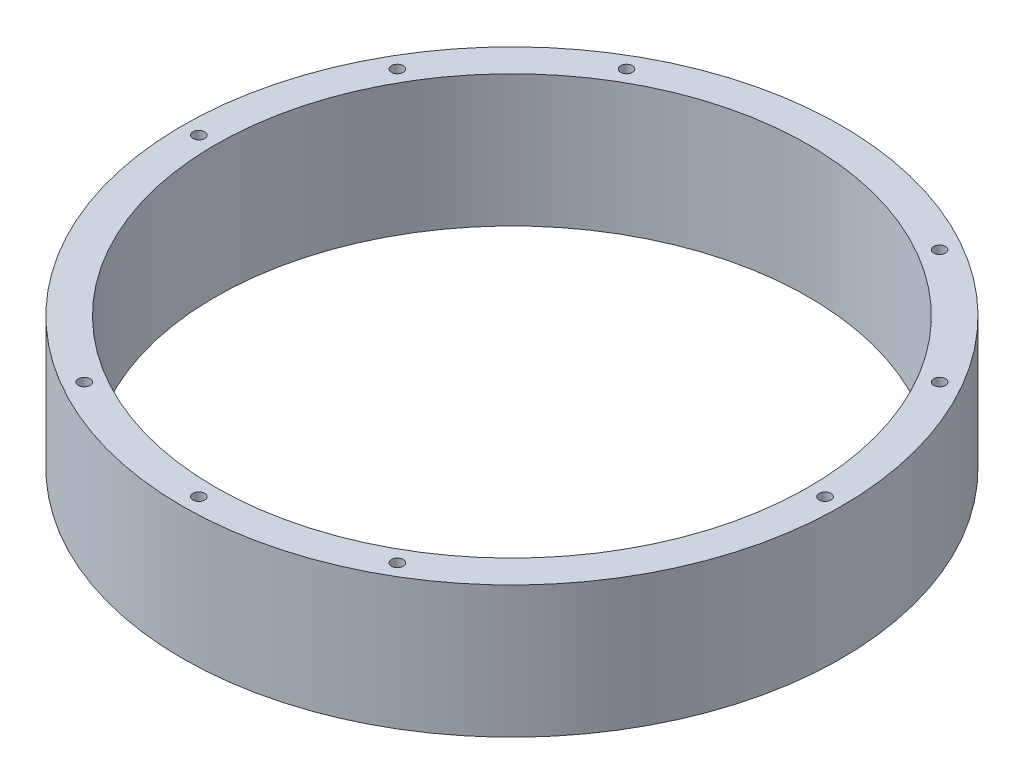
from build123d import *

# Parameters (mm, degrees)
SKETCH1_R           = 63.5
SKETCH1_R_2         = 57.15
BOSS_EXTRUDE1_DEPTH = 25.4
SKETCH2_R           = 1.1303
CUT_EXTRUDE1_DEPTH  = 94.3255592


with BuildPart() as part:
    # Sketch1 → Boss-Extrude1 (new body)
    with BuildSketch(Plane(origin=(0, 0, 0), x_dir=(1, 0, 0), z_dir=(0, 1, 0))):
        with Locations(Location((0, 0, 0), (0, 0, 270))):
            Circle(SKETCH1_R)
        with Locations(Location((0, 0, 0), (0, 0, 270))):
            Circle(SKETCH1_R_2, mode=Mode.SUBTRACT)
    extrude(amount=BOSS_EXTRUDE1_DEPTH)

    # Sketch2 → Cut-Extrude1 (cut, through all)
    with BuildSketch(Plane(origin=(0, 25.4, 0), x_dir=(1, 0, 0), z_dir=(0, 1, 0))):
        with Locations(Location((0, -60.325, 0), (0, 0, 270))):
            Circle(SKETCH2_R)
        with Locations(Location((-30.1625, -52.242982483, 0), (0, 0, 270))):
            Circle(SKETCH2_R)
        with Locations(Location((30.1625, -52.242982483, 0), (0, 0, 270))):
            Circle(SKETCH2_R)
        with Locations(Location((-30.1625, 52.242982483, 0), (0, 0, 270))):
            Circle(SKETCH2_R)
        with Locations(Location((-52.242982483, 30.1625, 0), (0, 0, 270))):
            Circle(SKETCH2_R)
        with Locations(Location((-60.325, 0, 0), (0, 0, 270))):
            Circle(SKETCH2_R)
        with Locations(Location((60.325, 0, 0), (0, 0, 270))):
            Circle(SKETCH2_R)
        with Locations(Location((52.242982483, 30.1625, 0), (0, 0, 270))):
            Circle(SKETCH2_R)
        with Locations(Location((30.1625, 52.242982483, 0), (0, 0, 270))):
            Circle(SKETCH2_R)
    extrude(amount=-CUT_EXTRUDE1_DEPTH, mode=Mode.SUBTRACT)


solid = part.part
